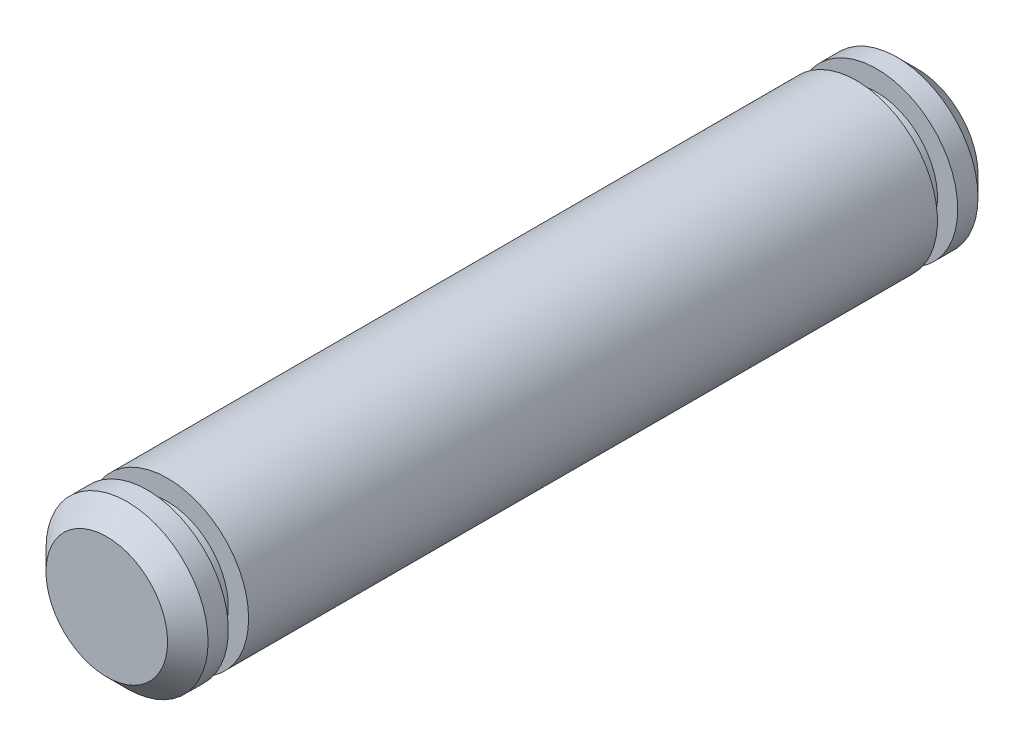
ISO-10303-21;
HEADER;
FILE_DESCRIPTION(('STEP AP214'),'2;1');
FILE_NAME('part.step','',(''),(''),'','','');
FILE_SCHEMA(('AUTOMOTIVE_DESIGN { 1 0 10303 214 1 1 1 1 }'));
ENDSEC;
DATA;
#1=APPLICATION_CONTEXT('core data for automotive mechanical design processes');
#2=APPLICATION_PROTOCOL_DEFINITION('international standard','automotive_design',2000,#1);
#3=PRODUCT_CONTEXT('',#1,'mechanical');
#4=PRODUCT('Part','Part','',(#3));
#5=PRODUCT_RELATED_PRODUCT_CATEGORY('part','',(#4));
#6=PRODUCT_DEFINITION_FORMATION('','',#4);
#7=PRODUCT_DEFINITION_CONTEXT('part definition',#1,'design');
#8=PRODUCT_DEFINITION('design','',#6,#7);
#9=PRODUCT_DEFINITION_SHAPE('','',#8);
#10=(LENGTH_UNIT() NAMED_UNIT(*) SI_UNIT(.MILLI.,.METRE.));
#11=(NAMED_UNIT(*) PLANE_ANGLE_UNIT() SI_UNIT($,.RADIAN.));
#12=(NAMED_UNIT(*) SI_UNIT($,.STERADIAN.) SOLID_ANGLE_UNIT());
#13=UNCERTAINTY_MEASURE_WITH_UNIT(LENGTH_MEASURE(1.E-05),#10,'distance_accuracy_value','');
#14=(GEOMETRIC_REPRESENTATION_CONTEXT(3) GLOBAL_UNCERTAINTY_ASSIGNED_CONTEXT((#13)) GLOBAL_UNIT_ASSIGNED_CONTEXT((#10,
#11,#12)) REPRESENTATION_CONTEXT('',''));
#15=CARTESIAN_POINT('',(0.,0.,0.));
#16=DIRECTION('',(0.,0.,1.));
#17=DIRECTION('',(1.,0.,0.));
#18=AXIS2_PLACEMENT_3D('',#15,#16,#17);
#19=CARTESIAN_POINT('',(-8.,0.,37.));
#20=DIRECTION('',(0.,0.,1.));
#21=DIRECTION('',(1.,0.,0.));
#22=AXIS2_PLACEMENT_3D('',#19,#20,#21);
#23=PLANE('',#22);
#24=CARTESIAN_POINT('',(0.,0.,37.));
#25=DIRECTION('',(0.,0.,-1.));
#26=DIRECTION('',(-1.,0.,0.));
#27=AXIS2_PLACEMENT_3D('',#24,#25,#26);
#28=CIRCLE('',#27,3.);
#29=CARTESIAN_POINT('',(-3.,0.,37.));
#30=VERTEX_POINT('',#29);
#31=EDGE_CURVE('E53',#30,#30,#28,.T.);
#32=ORIENTED_EDGE('',*,*,#31,.T.);
#33=EDGE_LOOP('',(#32));
#34=FACE_BOUND('',#33,.T.);
#35=CARTESIAN_POINT('',(0.,0.,37.));
#36=DIRECTION('',(0.,0.,1.));
#37=DIRECTION('',(1.,0.,0.));
#38=AXIS2_PLACEMENT_3D('',#35,#36,#37);
#39=CIRCLE('',#38,4.);
#40=CARTESIAN_POINT('',(4.,0.,37.));
#41=VERTEX_POINT('',#40);
#42=EDGE_CURVE('E46',#41,#41,#39,.T.);
#43=ORIENTED_EDGE('',*,*,#42,.T.);
#44=EDGE_LOOP('',(#43));
#45=FACE_BOUND('',#44,.T.);
#46=ADVANCED_FACE('F25',(#34,#45),#23,.T.);
#47=CARTESIAN_POINT('',(-3.,0.,38.));
#48=DIRECTION('',(0.,0.,-1.));
#49=DIRECTION('',(-1.,0.,0.));
#50=AXIS2_PLACEMENT_3D('',#47,#48,#49);
#51=PLANE('',#50);
#52=CARTESIAN_POINT('',(0.,0.,38.));
#53=DIRECTION('',(0.,0.,-1.));
#54=DIRECTION('',(-1.,0.,0.));
#55=AXIS2_PLACEMENT_3D('',#52,#53,#54);
#56=CIRCLE('',#55,3.);
#57=CARTESIAN_POINT('',(-3.,0.,38.));
#58=VERTEX_POINT('',#57);
#59=EDGE_CURVE('E66',#58,#58,#56,.T.);
#60=ORIENTED_EDGE('',*,*,#59,.F.);
#61=EDGE_LOOP('',(#60));
#62=FACE_BOUND('',#61,.T.);
#63=CARTESIAN_POINT('',(0.,0.,38.));
#64=DIRECTION('',(0.,0.,-1.));
#65=DIRECTION('',(-1.,0.,0.));
#66=AXIS2_PLACEMENT_3D('',#63,#64,#65);
#67=CIRCLE('',#66,4.);
#68=CARTESIAN_POINT('',(-4.,0.,38.));
#69=VERTEX_POINT('',#68);
#70=EDGE_CURVE('E50',#69,#69,#67,.T.);
#71=ORIENTED_EDGE('',*,*,#70,.T.);
#72=EDGE_LOOP('',(#71));
#73=FACE_BOUND('',#72,.T.);
#74=ADVANCED_FACE('F72',(#62,#73),#51,.T.);
#75=CARTESIAN_POINT('',(0.,0.,-3.57932841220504));
#76=DIRECTION('',(0.,0.,-1.));
#77=DIRECTION('',(-1.,0.,0.));
#78=AXIS2_PLACEMENT_3D('',#75,#76,#77);
#79=CYLINDRICAL_SURFACE('',#78,3.);
#80=ORIENTED_EDGE('',*,*,#31,.F.);
#81=EDGE_LOOP('',(#80));
#82=FACE_BOUND('',#81,.T.);
#83=ORIENTED_EDGE('',*,*,#59,.T.);
#84=EDGE_LOOP('',(#83));
#85=FACE_BOUND('',#84,.T.);
#86=ADVANCED_FACE('F70',(#82,#85),#79,.T.);
#87=CARTESIAN_POINT('',(0.,0.,40.));
#88=DIRECTION('',(0.,0.,1.));
#89=DIRECTION('',(1.,0.,0.));
#90=AXIS2_PLACEMENT_3D('',#87,#88,#89);
#91=PLANE('',#90);
#92=CARTESIAN_POINT('',(0.,0.,40.));
#93=DIRECTION('',(0.,0.,1.));
#94=DIRECTION('',(1.,0.,0.));
#95=AXIS2_PLACEMENT_3D('',#92,#93,#94);
#96=CIRCLE('',#95,2.99999999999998);
#97=CARTESIAN_POINT('',(2.99999999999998,0.,40.));
#98=VERTEX_POINT('',#97);
#99=EDGE_CURVE('E32',#98,#98,#96,.T.);
#100=ORIENTED_EDGE('',*,*,#99,.T.);
#101=EDGE_LOOP('',(#100));
#102=FACE_BOUND('',#101,.T.);
#103=ADVANCED_FACE('F80',(#102),#91,.T.);
#104=CARTESIAN_POINT('',(0.,0.,40.));
#105=DIRECTION('',(0.,0.,-1.));
#106=DIRECTION('',(-1.,0.,0.));
#107=AXIS2_PLACEMENT_3D('',#104,#105,#106);
#108=CYLINDRICAL_SURFACE('',#107,4.);
#109=CARTESIAN_POINT('',(0.,0.,39.));
#110=DIRECTION('',(0.,0.,1.));
#111=DIRECTION('',(1.,0.,0.));
#112=AXIS2_PLACEMENT_3D('',#109,#110,#111);
#113=CIRCLE('',#112,4.);
#114=CARTESIAN_POINT('',(4.,0.,39.));
#115=VERTEX_POINT('',#114);
#116=EDGE_CURVE('E10',#115,#115,#113,.F.);
#117=ORIENTED_EDGE('',*,*,#116,.T.);
#118=EDGE_LOOP('',(#117));
#119=FACE_BOUND('',#118,.T.);
#120=ORIENTED_EDGE('',*,*,#70,.F.);
#121=EDGE_LOOP('',(#120));
#122=FACE_BOUND('',#121,.T.);
#123=ADVANCED_FACE('F78',(#119,#122),#108,.T.);
#124=CARTESIAN_POINT('',(0.,0.,3.));
#125=DIRECTION('',(0.,0.,-1.));
#126=DIRECTION('',(-1.,0.,0.));
#127=AXIS2_PLACEMENT_3D('',#124,#125,#126);
#128=CIRCLE('',#127,4.);
#129=CARTESIAN_POINT('',(-4.,0.,3.));
#130=VERTEX_POINT('',#129);
#131=EDGE_CURVE('E45',#130,#130,#128,.T.);
#132=ORIENTED_EDGE('',*,*,#131,.F.);
#133=EDGE_LOOP('',(#132));
#134=FACE_BOUND('',#133,.T.);
#135=ORIENTED_EDGE('',*,*,#42,.F.);
#136=EDGE_LOOP('',(#135));
#137=FACE_BOUND('',#136,.T.);
#138=ADVANCED_FACE('F27',(#134,#137),#108,.T.);
#139=CARTESIAN_POINT('',(-3.,0.,3.));
#140=DIRECTION('',(0.,0.,-1.));
#141=DIRECTION('',(-1.,0.,0.));
#142=AXIS2_PLACEMENT_3D('',#139,#140,#141);
#143=PLANE('',#142);
#144=CARTESIAN_POINT('',(0.,0.,3.));
#145=DIRECTION('',(0.,0.,-1.));
#146=DIRECTION('',(-1.,0.,0.));
#147=AXIS2_PLACEMENT_3D('',#144,#145,#146);
#148=CIRCLE('',#147,3.);
#149=CARTESIAN_POINT('',(-3.,0.,3.));
#150=VERTEX_POINT('',#149);
#151=EDGE_CURVE('E59',#150,#150,#148,.T.);
#152=ORIENTED_EDGE('',*,*,#151,.F.);
#153=EDGE_LOOP('',(#152));
#154=FACE_BOUND('',#153,.T.);
#155=ORIENTED_EDGE('',*,*,#131,.T.);
#156=EDGE_LOOP('',(#155));
#157=FACE_BOUND('',#156,.T.);
#158=ADVANCED_FACE('F86',(#154,#157),#143,.T.);
#159=CARTESIAN_POINT('',(-8.,0.,2.));
#160=DIRECTION('',(0.,0.,1.));
#161=DIRECTION('',(1.,0.,0.));
#162=AXIS2_PLACEMENT_3D('',#159,#160,#161);
#163=PLANE('',#162);
#164=CARTESIAN_POINT('',(0.,0.,2.));
#165=DIRECTION('',(0.,0.,-1.));
#166=DIRECTION('',(-1.,0.,0.));
#167=AXIS2_PLACEMENT_3D('',#164,#165,#166);
#168=CIRCLE('',#167,3.);
#169=CARTESIAN_POINT('',(-3.,0.,2.));
#170=VERTEX_POINT('',#169);
#171=EDGE_CURVE('E49',#170,#170,#168,.T.);
#172=ORIENTED_EDGE('',*,*,#171,.T.);
#173=EDGE_LOOP('',(#172));
#174=FACE_BOUND('',#173,.T.);
#175=CARTESIAN_POINT('',(0.,0.,2.));
#176=DIRECTION('',(0.,0.,1.));
#177=DIRECTION('',(1.,0.,0.));
#178=AXIS2_PLACEMENT_3D('',#175,#176,#177);
#179=CIRCLE('',#178,4.);
#180=CARTESIAN_POINT('',(4.,0.,2.));
#181=VERTEX_POINT('',#180);
#182=EDGE_CURVE('E56',#181,#181,#179,.T.);
#183=ORIENTED_EDGE('',*,*,#182,.T.);
#184=EDGE_LOOP('',(#183));
#185=FACE_BOUND('',#184,.T.);
#186=ADVANCED_FACE('F100',(#174,#185),#163,.T.);
#187=CARTESIAN_POINT('',(0.,0.,-3.39366440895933));
#188=DIRECTION('',(0.,0.,-1.));
#189=DIRECTION('',(-1.,0.,0.));
#190=AXIS2_PLACEMENT_3D('',#187,#188,#189);
#191=CYLINDRICAL_SURFACE('',#190,3.);
#192=ORIENTED_EDGE('',*,*,#171,.F.);
#193=EDGE_LOOP('',(#192));
#194=FACE_BOUND('',#193,.T.);
#195=ORIENTED_EDGE('',*,*,#151,.T.);
#196=EDGE_LOOP('',(#195));
#197=FACE_BOUND('',#196,.T.);
#198=ADVANCED_FACE('F103',(#194,#197),#191,.T.);
#199=CARTESIAN_POINT('',(0.,0.,0.));
#200=DIRECTION('',(0.,0.,1.));
#201=DIRECTION('',(1.,0.,0.));
#202=AXIS2_PLACEMENT_3D('',#199,#200,#201);
#203=PLANE('',#202);
#204=CARTESIAN_POINT('',(0.,0.,0.));
#205=DIRECTION('',(0.,0.,1.));
#206=DIRECTION('',(1.,0.,0.));
#207=AXIS2_PLACEMENT_3D('',#204,#205,#206);
#208=CIRCLE('',#207,2.99999999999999);
#209=CARTESIAN_POINT('',(2.99999999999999,0.,0.));
#210=VERTEX_POINT('',#209);
#211=EDGE_CURVE('E36',#210,#210,#208,.F.);
#212=ORIENTED_EDGE('',*,*,#211,.T.);
#213=EDGE_LOOP('',(#212));
#214=FACE_BOUND('',#213,.T.);
#215=ADVANCED_FACE('F90',(#214),#203,.F.);
#216=CARTESIAN_POINT('',(0.,0.,1.00000000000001));
#217=DIRECTION('',(0.,0.,1.));
#218=DIRECTION('',(1.,0.,0.));
#219=AXIS2_PLACEMENT_3D('',#216,#217,#218);
#220=CIRCLE('',#219,4.);
#221=CARTESIAN_POINT('',(4.,0.,1.00000000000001));
#222=VERTEX_POINT('',#221);
#223=EDGE_CURVE('E40',#222,#222,#220,.T.);
#224=ORIENTED_EDGE('',*,*,#223,.T.);
#225=EDGE_LOOP('',(#224));
#226=FACE_BOUND('',#225,.T.);
#227=ORIENTED_EDGE('',*,*,#182,.F.);
#228=EDGE_LOOP('',(#227));
#229=FACE_BOUND('',#228,.T.);
#230=ADVANCED_FACE('F81',(#226,#229),#108,.T.);
#231=CARTESIAN_POINT('',(0.,0.,1.00000000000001));
#232=DIRECTION('',(0.,0.,1.));
#233=DIRECTION('',(1.,0.,0.));
#234=AXIS2_PLACEMENT_3D('',#231,#232,#233);
#235=CONICAL_SURFACE('',#234,4.,0.785398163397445);
#236=ORIENTED_EDGE('',*,*,#211,.F.);
#237=EDGE_LOOP('',(#236));
#238=FACE_BOUND('',#237,.T.);
#239=ORIENTED_EDGE('',*,*,#223,.F.);
#240=EDGE_LOOP('',(#239));
#241=FACE_BOUND('',#240,.T.);
#242=ADVANCED_FACE('F89',(#238,#241),#235,.T.);
#243=CARTESIAN_POINT('',(0.,0.,40.));
#244=DIRECTION('',(0.,0.,-1.));
#245=DIRECTION('',(-1.,0.,0.));
#246=AXIS2_PLACEMENT_3D('',#243,#244,#245);
#247=CONICAL_SURFACE('',#246,2.99999999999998,0.785398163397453);
#248=ORIENTED_EDGE('',*,*,#116,.F.);
#249=EDGE_LOOP('',(#248));
#250=FACE_BOUND('',#249,.T.);
#251=ORIENTED_EDGE('',*,*,#99,.F.);
#252=EDGE_LOOP('',(#251));
#253=FACE_BOUND('',#252,.T.);
#254=ADVANCED_FACE('F119',(#250,#253),#247,.T.);
#255=CLOSED_SHELL('',(#46,#74,#86,#103,#123,#138,#158,#186,#198,#215,#230,#242,#254));
#256=MANIFOLD_SOLID_BREP('B2',#255);
#257=ADVANCED_BREP_SHAPE_REPRESENTATION('',(#18,#256),#14);
#258=SHAPE_DEFINITION_REPRESENTATION(#9,#257);
ENDSEC;
END-ISO-10303-21;
